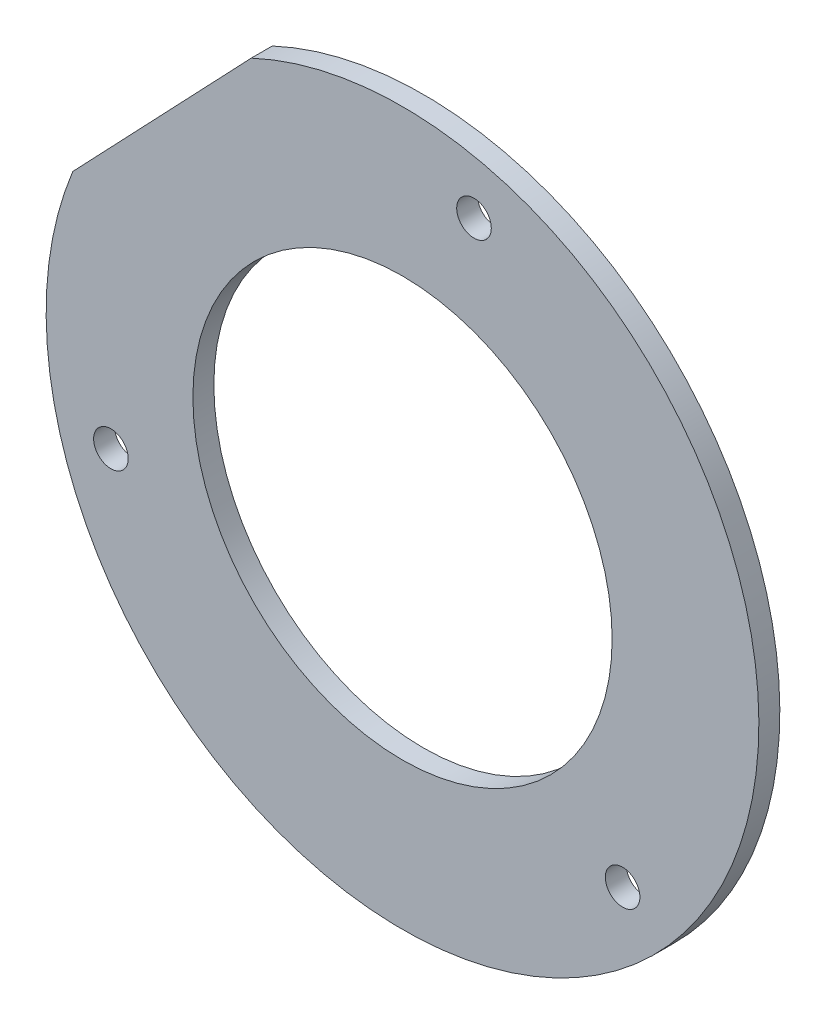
from build123d import *

# Parameters (mm, degrees)
SKETCH_1_R         = 20
EXTRUDE_1_DEPTH    = 2
HOLE_WIZARD_M4_1_D = 3.3


with BuildPart() as part:
    # Sketch 1 → Extrude 1 (new body)
    with BuildSketch(Plane.XY):
        with BuildLine():
            Line((2.569924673, 82.785920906), (-14.452802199, 64.912057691))
            ThreePointArc((-14.452802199, 64.912057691), (41.620689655, 28.551724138), (2.569924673, 82.785920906))
        make_face()
        with Locations((17, 52)):
            Circle(SKETCH_1_R, mode=Mode.SUBTRACT)
    extrude(amount=EXTRUDE_1_DEPTH)

    # Hole Wizard M4 _1 (through all)
    with Locations(Plane.XY.offset(2)):
        with Locations((23.820508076, 80.186533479), (-10.820508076, 43.813466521), (38, 32)):
            Hole(HOLE_WIZARD_M4_1_D / 2)


solid = part.part
